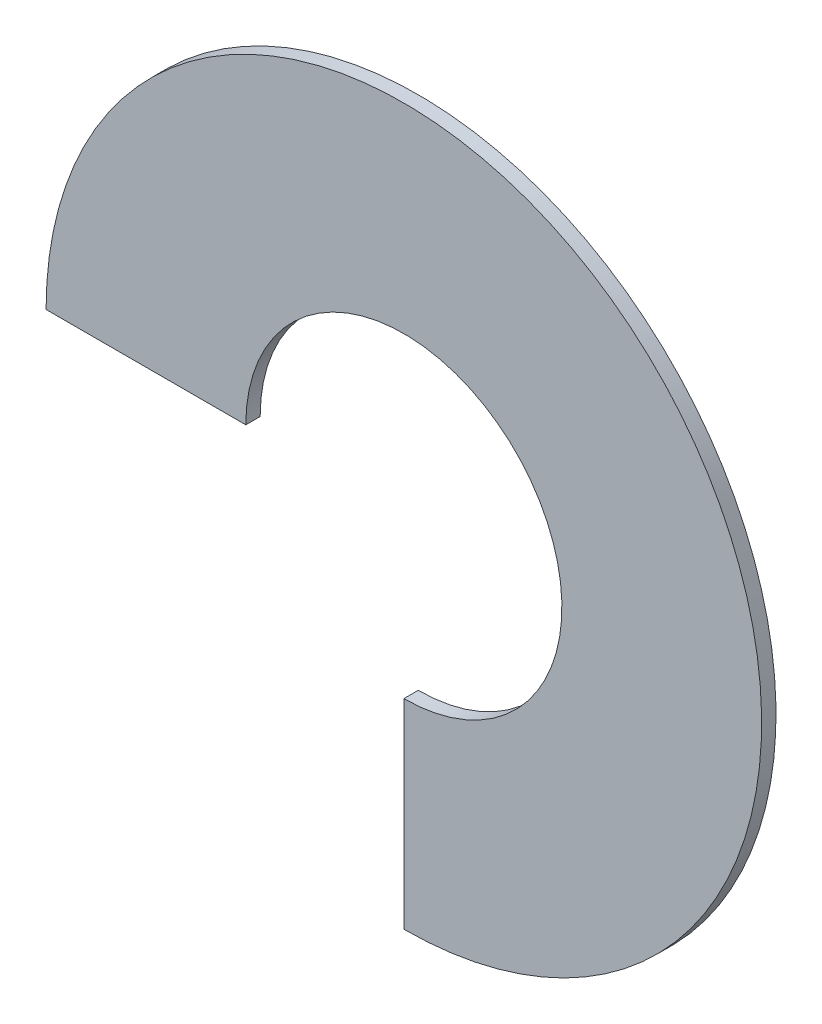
from build123d import *

# Parameters (mm, degrees)
ESQUISSE1_R             = 12.45
ESQUISSE1_R_2           = 5.5
EXTRUSION1_DEPTH        = 0.5
ESQUISSE2_W             = 17.624691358
ESQUISSE2_H             = 21.318973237
ENL_V_MAT_EXTRU_1_DEPTH = 18.614056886


with BuildPart() as part:
    # Esquisse1 → Extrusion1 (new body)
    with BuildSketch(Plane.XY):
        Circle(ESQUISSE1_R)
        Circle(ESQUISSE1_R_2, mode=Mode.SUBTRACT)
    extrude(amount=EXTRUSION1_DEPTH)

    # Esquisse2 → Enl_v. mat.-Extru.1 (cut, through all)
    with BuildSketch(Plane(origin=(0, 0, 0), x_dir=(0, 0, -1), z_dir=(1, 0, 0))):
        with Locations((-0.557407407, -10.659486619)):
            Rectangle(ESQUISSE2_W, ESQUISSE2_H)
    extrude(amount=-ENL_V_MAT_EXTRU_1_DEPTH, mode=Mode.SUBTRACT)


solid = part.part
